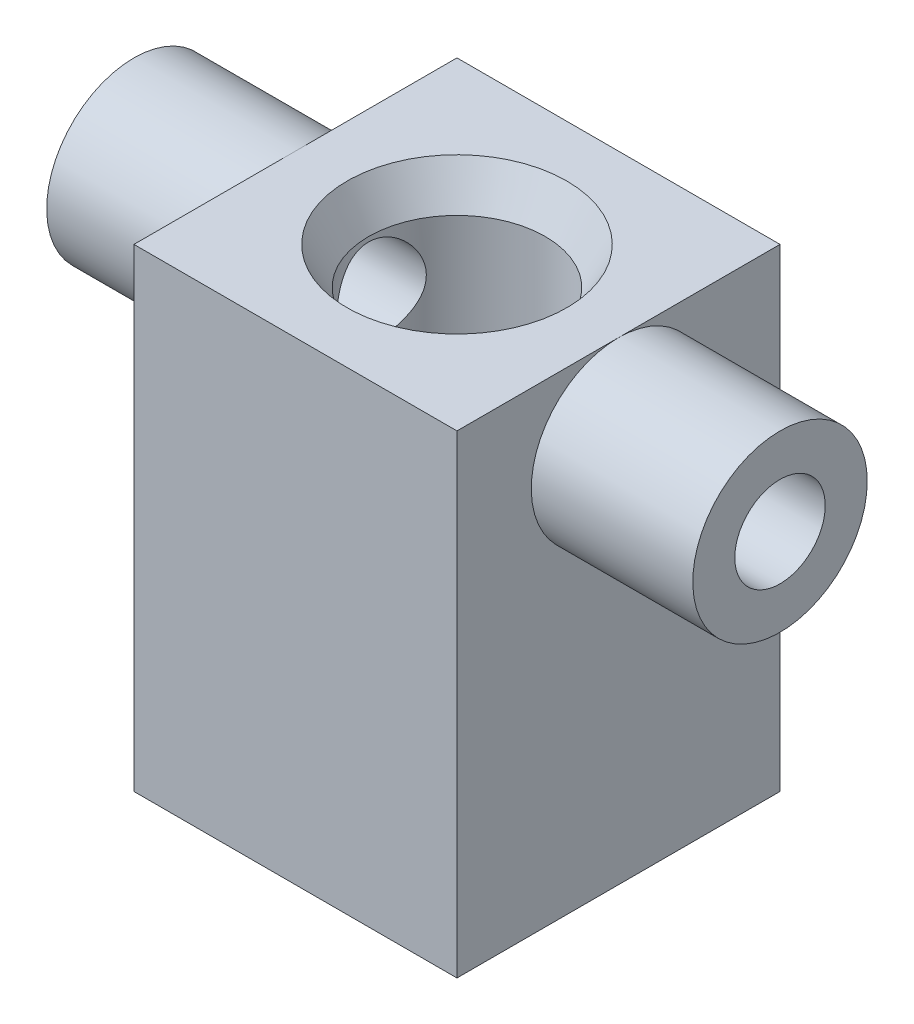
from build123d import *
from OCP.BRepFilletAPI import BRepFilletAPI_MakeChamfer

# Parameters (mm, degrees)
SKETCH2_W           = 15
SKETCH2_H           = 22
BOSS_EXTRUDE1_DEPTH = 7.5
SKETCH3_R           = 4.05
BOSS_EXTRUDE2_DEPTH = 15
SKETCH4_R           = 4.1
CUT_EXTRUDE1_DEPTH  = 28.663152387
SKETCH5_R           = 2.1
CUT_EXTRUDE2_DEPTH  = 33.821486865
CHAMFER1_SIZE       = 1
CHAMFER1_SIZE2      = 1.732050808


with BuildPart() as part:
    # Sketch2 → Boss-Extrude1 (new, symmetric)
    with BuildSketch(Plane.XY):
        Rectangle(SKETCH2_W, SKETCH2_H)
    extrude(amount=BOSS_EXTRUDE1_DEPTH, both=True)

    # Sketch3 → Boss-Extrude2 (add, symmetric)
    with BuildSketch(Plane(origin=(0, 0, 0), x_dir=(0, 0, -1), z_dir=(1, 0, 0))):
        with Locations(Location((0, 6.95, 0), (0, 0, 90))):
            Circle(SKETCH3_R)
    extrude(amount=BOSS_EXTRUDE2_DEPTH, both=True)

    # Sketch4 → Cut-Extrude1 (cut, through all)
    with BuildSketch(Plane(origin=(0, 11, 0), x_dir=(1, 0, 0), z_dir=(0, 1, 0))):
        with Locations(Location((0, 0, 0), (0, 0, 270))):
            Circle(SKETCH4_R)
    extrude(amount=-CUT_EXTRUDE1_DEPTH, mode=Mode.SUBTRACT)

    # Sketch5 → Cut-Extrude2 (cut, through all)
    with BuildSketch(Plane.ZY.offset(15)):
        with Locations((0, 6.95)):
            Circle(SKETCH5_R)
    extrude(amount=-CUT_EXTRUDE2_DEPTH, mode=Mode.SUBTRACT)

    # Chamfer1: one chamfer whose edges measure the first distance from different faces: ONE call of the kernel's chamfer builder (chamfer() names one face for all edges)
    chamfer1_edges_1 = [part.edges().sort_by_distance(p)[0] for p in [
        (0, -11, -4.1),
    ]]
    chamfer1_side_1 = [part.faces().sort_by_distance(p)[0] for p in [
        (0, -11, -7.287867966),
    ]]
    chamfer1_edges_2 = [part.edges().sort_by_distance(p)[0] for p in [
        (0, 11, -4.1),
    ]]
    chamfer1_side_2 = [part.faces().sort_by_distance(p)[0] for p in [
        (7.287867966, 11, -3.75),
    ]]
    chamfer1 = BRepFilletAPI_MakeChamfer(part.part.solid().wrapped)
    for e in chamfer1_edges_1:
        chamfer1.Add(CHAMFER1_SIZE, CHAMFER1_SIZE2, e.wrapped, chamfer1_side_1[0].wrapped)  # the first distance lies on this face
    for e in chamfer1_edges_2:
        chamfer1.Add(CHAMFER1_SIZE, CHAMFER1_SIZE2, e.wrapped, chamfer1_side_2[0].wrapped)  # the first distance lies on this face
    add(Compound.cast(chamfer1.Shape()), mode=Mode.REPLACE)


solid = part.part
